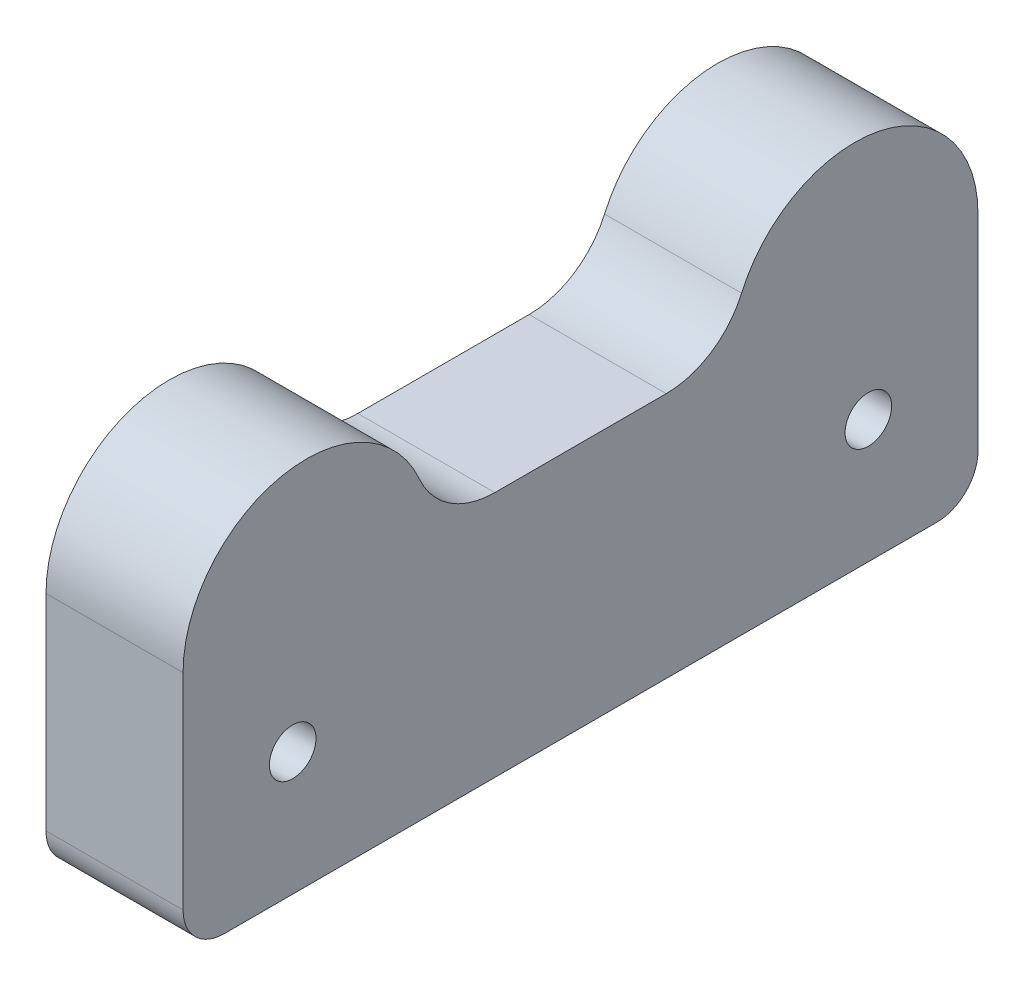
from build123d import *

# Parameters (mm, degrees)
SKETCH4_W           = 58
SKETCH4_H           = 18
BOSS_EXTRUDE1_DEPTH = 10
SKETCH5_R           = 9
BOSS_EXTRUDE2_DEPTH = 10
SKETCH6_R           = 1.7
CUT_EXTRUDE1_DEPTH  = 65.75337829
FILLET1_R           = 3
FILLET2_R           = 6


with BuildPart() as part:
    # Sketch4 → Boss-Extrude1 (new body)
    with BuildSketch(Plane(origin=(0, 0, 0), x_dir=(0, 0, -1), z_dir=(1, 0, 0))):
        with Locations((29, 9)):
            Rectangle(SKETCH4_W, SKETCH4_H)
    extrude(amount=BOSS_EXTRUDE1_DEPTH)

    # Sketch5 → Boss-Extrude2 (add)
    with BuildSketch(Plane(origin=(10, 0, 0), x_dir=(0, 0, -1), z_dir=(1, 0, 0))):
        with Locations((9, 18)):
            Circle(SKETCH5_R)
        with Locations((49, 18)):
            Circle(SKETCH5_R)
    extrude(amount=-BOSS_EXTRUDE2_DEPTH)

    # Sketch6 → Cut-Extrude1 (cut, through all)
    with BuildSketch(Plane(origin=(10, 0, 0), x_dir=(0, 0, -1), z_dir=(1, 0, 0))):
        with Locations((8, 9)):
            Circle(SKETCH6_R)
        with Locations((50, 9)):
            Circle(SKETCH6_R)
    extrude(amount=-CUT_EXTRUDE1_DEPTH, mode=Mode.SUBTRACT)

    # Fillet1
    fillet1_edges = [part.edges().sort_by_distance(p)[0] for p in [
        (5, 0, -58),
        (5, 0, 0),
    ]]
    fillet(fillet1_edges, radius=FILLET1_R)

    # Fillet2
    fillet2_edges = [part.edges().sort_by_distance(p)[0] for p in [
        (5, 18, -18),
        (5, 18, -40),
    ]]
    fillet(fillet2_edges, radius=FILLET2_R)


solid = part.part
